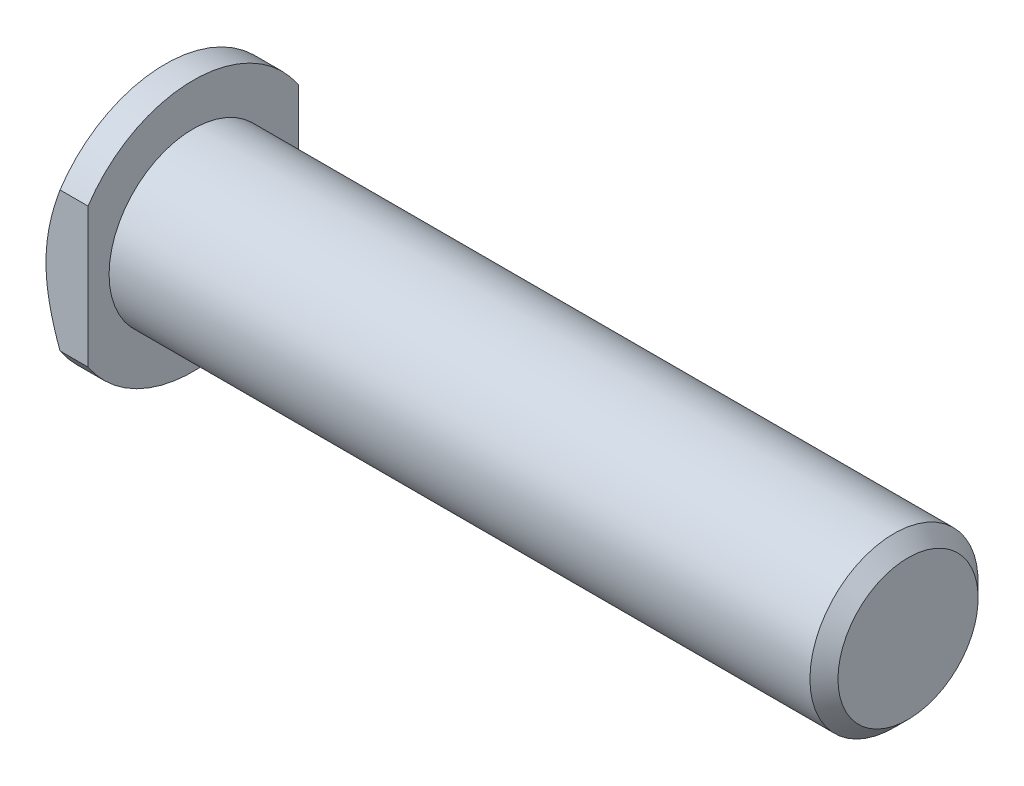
ISO-10303-21;
HEADER;
FILE_DESCRIPTION(('STEP AP214'),'2;1');
FILE_NAME('part.step','',(''),(''),'','','');
FILE_SCHEMA(('AUTOMOTIVE_DESIGN { 1 0 10303 214 1 1 1 1 }'));
ENDSEC;
DATA;
#1=APPLICATION_CONTEXT('core data for automotive mechanical design processes');
#2=APPLICATION_PROTOCOL_DEFINITION('international standard','automotive_design',2000,#1);
#3=PRODUCT_CONTEXT('',#1,'mechanical');
#4=PRODUCT('Part','Part','',(#3));
#5=PRODUCT_RELATED_PRODUCT_CATEGORY('part','',(#4));
#6=PRODUCT_DEFINITION_FORMATION('','',#4);
#7=PRODUCT_DEFINITION_CONTEXT('part definition',#1,'design');
#8=PRODUCT_DEFINITION('design','',#6,#7);
#9=PRODUCT_DEFINITION_SHAPE('','',#8);
#10=(LENGTH_UNIT() NAMED_UNIT(*) SI_UNIT(.MILLI.,.METRE.));
#11=(NAMED_UNIT(*) PLANE_ANGLE_UNIT() SI_UNIT($,.RADIAN.));
#12=(NAMED_UNIT(*) SI_UNIT($,.STERADIAN.) SOLID_ANGLE_UNIT());
#13=UNCERTAINTY_MEASURE_WITH_UNIT(LENGTH_MEASURE(1.E-05),#10,'distance_accuracy_value','');
#14=(GEOMETRIC_REPRESENTATION_CONTEXT(3) GLOBAL_UNCERTAINTY_ASSIGNED_CONTEXT((#13)) GLOBAL_UNIT_ASSIGNED_CONTEXT((#10,
#11,#12)) REPRESENTATION_CONTEXT('',''));
#15=CARTESIAN_POINT('',(0.,0.,0.));
#16=DIRECTION('',(0.,0.,1.));
#17=DIRECTION('',(1.,0.,0.));
#18=AXIS2_PLACEMENT_3D('',#15,#16,#17);
#19=CARTESIAN_POINT('',(8.00000000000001,12.,0.));
#20=DIRECTION('',(-1.,0.,0.));
#21=DIRECTION('',(0.,0.,1.));
#22=AXIS2_PLACEMENT_3D('',#19,#20,#21);
#23=PLANE('',#22);
#24=CARTESIAN_POINT('',(8.00000000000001,0.,0.));
#25=DIRECTION('',(-1.,0.,0.));
#26=DIRECTION('',(0.,0.,1.));
#27=AXIS2_PLACEMENT_3D('',#24,#25,#26);
#28=CIRCLE('',#27,12.);
#29=CARTESIAN_POINT('',(8.00000000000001,0.,12.));
#30=VERTEX_POINT('',#29);
#31=EDGE_CURVE('E95',#30,#30,#28,.T.);
#32=ORIENTED_EDGE('',*,*,#31,.T.);
#33=EDGE_LOOP('',(#32));
#34=FACE_BOUND('',#33,.T.);
#35=DIRECTION('',(0.,-1.,0.));
#36=VECTOR('',#35,1.);
#37=CARTESIAN_POINT('',(8.00000000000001,17.8551195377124,15.));
#38=LINE('',#37,#36);
#39=CARTESIAN_POINT('',(8.00000000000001,9.9498743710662,15.));
#40=VERTEX_POINT('',#39);
#41=CARTESIAN_POINT('',(8.00000000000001,-9.9498743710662,15.));
#42=VERTEX_POINT('',#41);
#43=EDGE_CURVE('E73',#40,#42,#38,.T.);
#44=ORIENTED_EDGE('',*,*,#43,.T.);
#45=CARTESIAN_POINT('',(8.00000000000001,0.,0.));
#46=DIRECTION('',(-1.,0.,0.));
#47=DIRECTION('',(0.,0.,1.));
#48=AXIS2_PLACEMENT_3D('',#45,#46,#47);
#49=CIRCLE('',#48,18.);
#50=CARTESIAN_POINT('',(8.00000000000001,-9.9498743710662,-15.));
#51=VERTEX_POINT('',#50);
#52=EDGE_CURVE('E92',#51,#42,#49,.T.);
#53=ORIENTED_EDGE('',*,*,#52,.F.);
#54=DIRECTION('',(0.,-1.,0.));
#55=VECTOR('',#54,1.);
#56=CARTESIAN_POINT('',(8.00000000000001,17.8551195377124,-15.));
#57=LINE('',#56,#55);
#58=CARTESIAN_POINT('',(8.00000000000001,9.9498743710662,-15.));
#59=VERTEX_POINT('',#58);
#60=EDGE_CURVE('E89',#59,#51,#57,.T.);
#61=ORIENTED_EDGE('',*,*,#60,.F.);
#62=EDGE_CURVE('E85',#40,#59,#49,.T.);
#63=ORIENTED_EDGE('',*,*,#62,.F.);
#64=EDGE_LOOP('',(#44,#53,#61,#63));
#65=FACE_BOUND('',#64,.T.);
#66=ADVANCED_FACE('F32',(#34,#65),#23,.F.);
#67=CARTESIAN_POINT('',(0.,0.,0.));
#68=DIRECTION('',(-1.,0.,0.));
#69=DIRECTION('',(0.,0.,1.));
#70=AXIS2_PLACEMENT_3D('',#67,#68,#69);
#71=CYLINDRICAL_SURFACE('',#70,18.);
#72=DIRECTION('',(-1.,0.,0.));
#73=VECTOR('',#72,1.);
#74=CARTESIAN_POINT('',(0.,9.9498743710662,15.));
#75=LINE('',#74,#73);
#76=CARTESIAN_POINT('',(4.00000000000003,9.9498743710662,15.));
#77=VERTEX_POINT('',#76);
#78=EDGE_CURVE('E47',#40,#77,#75,.T.);
#79=ORIENTED_EDGE('',*,*,#78,.F.);
#80=ORIENTED_EDGE('',*,*,#62,.T.);
#81=DIRECTION('',(-1.,0.,0.));
#82=VECTOR('',#81,1.);
#83=CARTESIAN_POINT('',(0.,9.9498743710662,-15.));
#84=LINE('',#83,#82);
#85=CARTESIAN_POINT('',(4.00000000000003,9.9498743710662,-15.));
#86=VERTEX_POINT('',#85);
#87=EDGE_CURVE('E93',#59,#86,#84,.T.);
#88=ORIENTED_EDGE('',*,*,#87,.T.);
#89=CARTESIAN_POINT('',(4.00000000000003,0.,0.));
#90=DIRECTION('',(1.,0.,0.));
#91=DIRECTION('',(0.,0.,-1.));
#92=AXIS2_PLACEMENT_3D('',#89,#90,#91);
#93=CIRCLE('',#92,18.);
#94=EDGE_CURVE('E88',#86,#77,#93,.T.);
#95=ORIENTED_EDGE('',*,*,#94,.T.);
#96=EDGE_LOOP('',(#79,#80,#88,#95));
#97=FACE_BOUND('',#96,.T.);
#98=ADVANCED_FACE('F83',(#97),#71,.T.);
#99=DIRECTION('',(-1.,0.,0.));
#100=VECTOR('',#99,1.);
#101=CARTESIAN_POINT('',(0.,-9.94987437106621,15.));
#102=LINE('',#101,#100);
#103=CARTESIAN_POINT('',(4.00000000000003,-9.9498743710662,15.));
#104=VERTEX_POINT('',#103);
#105=EDGE_CURVE('E75',#104,#42,#102,.F.);
#106=ORIENTED_EDGE('',*,*,#105,.F.);
#107=CARTESIAN_POINT('',(4.00000000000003,-9.9498743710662,-15.));
#108=VERTEX_POINT('',#107);
#109=EDGE_CURVE('E55',#104,#108,#93,.T.);
#110=ORIENTED_EDGE('',*,*,#109,.T.);
#111=DIRECTION('',(-1.,0.,0.));
#112=VECTOR('',#111,1.);
#113=CARTESIAN_POINT('',(0.,-9.94987437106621,-15.));
#114=LINE('',#113,#112);
#115=EDGE_CURVE('E96',#108,#51,#114,.F.);
#116=ORIENTED_EDGE('',*,*,#115,.T.);
#117=ORIENTED_EDGE('',*,*,#52,.T.);
#118=EDGE_LOOP('',(#106,#110,#116,#117));
#119=FACE_BOUND('',#118,.T.);
#120=ADVANCED_FACE('F129',(#119),#71,.T.);
#121=CARTESIAN_POINT('',(0.,0.,0.));
#122=DIRECTION('',(1.,0.,0.));
#123=DIRECTION('',(0.,0.,-1.));
#124=AXIS2_PLACEMENT_3D('',#121,#122,#123);
#125=CONICAL_SURFACE('',#124,12.,0.982793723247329);
#126=CARTESIAN_POINT('',(0.,0.,0.));
#127=DIRECTION('',(1.,0.,0.));
#128=DIRECTION('',(0.,0.,-1.));
#129=AXIS2_PLACEMENT_3D('',#126,#127,#128);
#130=CIRCLE('',#129,12.);
#131=CARTESIAN_POINT('',(0.,0.,-12.));
#132=VERTEX_POINT('',#131);
#133=EDGE_CURVE('E102',#132,#132,#130,.F.);
#134=ORIENTED_EDGE('',*,*,#133,.F.);
#135=EDGE_LOOP('',(#134));
#136=FACE_BOUND('',#135,.T.);
#137=ORIENTED_EDGE('',*,*,#109,.F.);
#138=CARTESIAN_POINT('',(13.2153555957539,-28.0660908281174,15.));
#139=CARTESIAN_POINT('',(13.0118041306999,-27.7198880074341,15.));
#140=CARTESIAN_POINT('',(12.808870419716,-27.3733220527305,15.));
#141=CARTESIAN_POINT('',(12.4043725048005,-26.6793895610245,15.));
#142=CARTESIAN_POINT('',(12.2028083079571,-26.3320230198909,15.));
#143=CARTESIAN_POINT('',(11.6003401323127,-25.2885575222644,15.));
#144=CARTESIAN_POINT('',(11.2016950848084,-24.5911512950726,15.));
#145=CARTESIAN_POINT('',(10.4104607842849,-23.1897769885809,15.));
#146=CARTESIAN_POINT('',(10.0178967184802,-22.4857946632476,15.));
#147=CARTESIAN_POINT('',(9.24206826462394,-21.0727469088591,15.));
#148=CARTESIAN_POINT('',(8.85880357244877,-20.3636816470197,15.));
#149=CARTESIAN_POINT('',(8.0775484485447,-18.8894504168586,15.));
#150=CARTESIAN_POINT('',(7.68040587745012,-18.1238325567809,15.));
#151=CARTESIAN_POINT('',(7.09782334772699,-16.9687264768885,15.));
#152=CARTESIAN_POINT('',(6.90580585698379,-16.5825529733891,15.));
#153=CARTESIAN_POINT('',(6.52683358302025,-15.8077325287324,15.));
#154=CARTESIAN_POINT('',(6.33987871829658,-15.419085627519,15.));
#155=CARTESIAN_POINT('',(5.97202552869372,-14.6395042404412,15.));
#156=CARTESIAN_POINT('',(5.79112017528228,-14.2485730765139,15.));
#157=CARTESIAN_POINT('',(5.43605699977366,-13.4636651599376,15.));
#158=CARTESIAN_POINT('',(5.26189898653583,-13.0696884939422,15.));
#159=CARTESIAN_POINT('',(4.92144545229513,-12.278426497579,15.));
#160=CARTESIAN_POINT('',(4.75514854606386,-11.881141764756,15.));
#161=CARTESIAN_POINT('',(4.43167879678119,-11.0828868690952,15.));
#162=CARTESIAN_POINT('',(4.27450548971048,-10.6819168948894,15.));
#163=CARTESIAN_POINT('',(3.97273926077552,-9.8811566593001,15.));
#164=CARTESIAN_POINT('',(3.82801023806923,-9.48141787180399,15.));
#165=CARTESIAN_POINT('',(3.55057647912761,-8.67777299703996,15.));
#166=CARTESIAN_POINT('',(3.41787167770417,-8.27386693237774,15.));
#167=CARTESIAN_POINT('',(3.1663755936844,-7.46171395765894,15.));
#168=CARTESIAN_POINT('',(3.04758460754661,-7.05346695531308,15.));
#169=CARTESIAN_POINT('',(2.82599529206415,-6.23262990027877,15.));
#170=CARTESIAN_POINT('',(2.72319686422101,-5.82003987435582,15.));
#171=CARTESIAN_POINT('',(2.53792243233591,-5.00027753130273,15.));
#172=CARTESIAN_POINT('',(2.45503290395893,-4.59319929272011,15.));
#173=CARTESIAN_POINT('',(2.30856942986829,-3.77556162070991,15.));
#174=CARTESIAN_POINT('',(2.24499514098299,-3.36500224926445,15.));
#175=CARTESIAN_POINT('',(2.13892229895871,-2.54128280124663,15.));
#176=CARTESIAN_POINT('',(2.0964168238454,-2.12812362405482,15.));
#177=CARTESIAN_POINT('',(2.03374554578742,-1.30010234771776,15.));
#178=CARTESIAN_POINT('',(2.0135795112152,-0.885240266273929,15.));
#179=CARTESIAN_POINT('',(1.99622042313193,-0.0540206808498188,15.));
#180=CARTESIAN_POINT('',(1.99908338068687,0.362338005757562,15.));
#181=CARTESIAN_POINT('',(2.02782051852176,1.19425427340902,15.));
#182=CARTESIAN_POINT('',(2.05369480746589,1.60981185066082,15.));
#183=CARTESIAN_POINT('',(2.12762764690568,2.43901465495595,15.));
#184=CARTESIAN_POINT('',(2.17569067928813,2.85265947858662,15.));
#185=CARTESIAN_POINT('',(2.29256462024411,3.67698972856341,15.));
#186=CARTESIAN_POINT('',(2.36137597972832,4.08767509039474,15.));
#187=CARTESIAN_POINT('',(2.52003393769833,4.91649038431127,15.));
#188=CARTESIAN_POINT('',(2.61040050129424,5.33452007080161,15.));
#189=CARTESIAN_POINT('',(2.80889749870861,6.16631621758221,15.));
#190=CARTESIAN_POINT('',(2.91702826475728,6.58008259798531,15.));
#191=CARTESIAN_POINT('',(3.14886963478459,7.40325258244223,15.));
#192=CARTESIAN_POINT('',(3.27258200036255,7.81265568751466,15.));
#193=CARTESIAN_POINT('',(3.53350979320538,8.62708584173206,15.));
#194=CARTESIAN_POINT('',(3.67072456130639,9.03211310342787,15.));
#195=CARTESIAN_POINT('',(4.06589011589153,10.1454449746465,15.));
#196=CARTESIAN_POINT('',(4.3360937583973,10.8494036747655,15.));
#197=CARTESIAN_POINT('',(4.90412713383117,12.2461519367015,15.));
#198=CARTESIAN_POINT('',(5.20196436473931,12.9389384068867,15.));
#199=CARTESIAN_POINT('',(5.81911432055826,14.315640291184,15.));
#200=CARTESIAN_POINT('',(6.13844772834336,14.9995463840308,15.));
#201=CARTESIAN_POINT('',(6.79350265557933,16.3593430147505,15.));
#202=CARTESIAN_POINT('',(7.12922263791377,17.0352342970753,15.));
#203=CARTESIAN_POINT('',(7.8149571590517,18.383265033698,15.));
#204=CARTESIAN_POINT('',(8.16502562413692,19.0553769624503,15.));
#205=CARTESIAN_POINT('',(8.87545145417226,20.394141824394,15.));
#206=CARTESIAN_POINT('',(9.23580900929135,21.0607946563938,15.));
#207=CARTESIAN_POINT('',(9.96458489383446,22.3892041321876,15.));
#208=CARTESIAN_POINT('',(10.3329987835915,23.050963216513,15.));
#209=CARTESIAN_POINT('',(11.0765277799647,24.3706934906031,15.));
#210=CARTESIAN_POINT('',(11.451642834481,25.0286647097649,15.));
#211=CARTESIAN_POINT('',(12.161227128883,26.2612509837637,15.));
#212=CARTESIAN_POINT('',(12.4950641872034,26.8362304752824,15.));
#213=CARTESIAN_POINT('',(13.1663541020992,27.9840759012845,15.));
#214=CARTESIAN_POINT('',(13.5038069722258,28.556941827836,15.));
#215=CARTESIAN_POINT('',(14.5208735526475,30.2729632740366,15.));
#216=CARTESIAN_POINT('',(15.205103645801,31.4133840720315,15.));
#217=CARTESIAN_POINT('',(16.2353087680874,33.114846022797,15.));
#218=CARTESIAN_POINT('',(16.5778239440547,33.6779903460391,15.));
#219=CARTESIAN_POINT('',(17.2648408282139,34.8030674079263,15.));
#220=CARTESIAN_POINT('',(17.6093425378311,35.3650001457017,15.));
#221=CARTESIAN_POINT('',(18.3000184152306,36.4876890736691,15.));
#222=CARTESIAN_POINT('',(18.646192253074,37.048445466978,15.));
#223=CARTESIAN_POINT('',(19.3400795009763,38.1690023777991,15.));
#224=CARTESIAN_POINT('',(19.6877929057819,38.7288028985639,15.));
#225=CARTESIAN_POINT('',(20.0361783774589,39.2881842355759,15.));
#226=B_SPLINE_CURVE_WITH_KNOTS('',3,(#138,#139,#140,#141,#142,#143,#144,#145,#146,#147,#148,
#149,#150,#151,#152,#153,#154,#155,#156,#157,#158,#159,#160,#161,#162,#163,#164,#165,#166,#167,
#168,#169,#170,#171,#172,#173,#174,#175,#176,#177,#178,#179,#180,#181,#182,#183,#184,#185,#186,
#187,#188,#189,#190,#191,#192,#193,#194,#195,#196,#197,#198,#199,#200,#201,#202,#203,#204,#205,
#206,#207,#208,#209,#210,#211,#212,#213,#214,#215,#216,#217,#218,#219,#220,#221,#222,#223,#224,
#225),.UNSPECIFIED.,.F.,.F.,(4,2,2,2,2,2,2,2,2,2,2,2,2,2,2,2,2,2,2,2,2,2,2,2,2,2,2,2,2,2,2,2,2,
2,2,2,2,2,2,2,2,2,2,4),(0.,1.20482515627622,2.40965654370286,4.81952335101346,7.23758072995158,
9.65555892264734,12.2428369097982,13.536641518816,14.8304252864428,16.1226496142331,
17.4148373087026,18.706796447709,19.9986898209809,21.2739224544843,22.5491481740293,
23.824401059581,25.0996460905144,26.3455204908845,27.5913727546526,28.836815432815,
30.0822451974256,31.3307050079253,32.579170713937,33.8278887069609,35.0766338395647,
36.3592521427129,37.6418944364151,38.9246818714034,40.2074067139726,42.46865583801,
44.7305203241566,46.9945930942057,49.258453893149,51.5317856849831,53.8051595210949,
56.0773106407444,58.3494441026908,60.3440312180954,62.3386258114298,66.3283638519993,
68.3057423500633,70.2831222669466,72.2601267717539,74.2371245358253),.UNSPECIFIED.);
#227=EDGE_CURVE('E112',#104,#77,#226,.T.);
#228=ORIENTED_EDGE('',*,*,#227,.T.);
#229=ORIENTED_EDGE('',*,*,#94,.F.);
#230=CARTESIAN_POINT('',(13.2153555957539,-28.0660908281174,-15.));
#231=CARTESIAN_POINT('',(13.0118041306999,-27.7198880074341,-15.));
#232=CARTESIAN_POINT('',(12.808870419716,-27.3733220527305,-15.));
#233=CARTESIAN_POINT('',(12.4043725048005,-26.6793895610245,-15.));
#234=CARTESIAN_POINT('',(12.2028083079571,-26.3320230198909,-15.));
#235=CARTESIAN_POINT('',(11.6003401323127,-25.2885575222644,-15.));
#236=CARTESIAN_POINT('',(11.2016950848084,-24.5911512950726,-15.));
#237=CARTESIAN_POINT('',(10.4104607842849,-23.1897769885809,-15.));
#238=CARTESIAN_POINT('',(10.0178967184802,-22.4857946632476,-15.));
#239=CARTESIAN_POINT('',(9.24206826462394,-21.0727469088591,-15.));
#240=CARTESIAN_POINT('',(8.85880357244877,-20.3636816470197,-15.));
#241=CARTESIAN_POINT('',(8.0775484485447,-18.8894504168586,-15.));
#242=CARTESIAN_POINT('',(7.68040587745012,-18.1238325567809,-15.));
#243=CARTESIAN_POINT('',(7.09782334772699,-16.9687264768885,-15.));
#244=CARTESIAN_POINT('',(6.90580585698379,-16.5825529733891,-15.));
#245=CARTESIAN_POINT('',(6.52683358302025,-15.8077325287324,-15.));
#246=CARTESIAN_POINT('',(6.33987871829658,-15.419085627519,-15.));
#247=CARTESIAN_POINT('',(5.97202552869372,-14.6395042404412,-15.));
#248=CARTESIAN_POINT('',(5.79112017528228,-14.2485730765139,-15.));
#249=CARTESIAN_POINT('',(5.43605699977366,-13.4636651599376,-15.));
#250=CARTESIAN_POINT('',(5.26189898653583,-13.0696884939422,-15.));
#251=CARTESIAN_POINT('',(4.92144545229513,-12.278426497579,-15.));
#252=CARTESIAN_POINT('',(4.75514854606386,-11.881141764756,-15.));
#253=CARTESIAN_POINT('',(4.43167879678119,-11.0828868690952,-15.));
#254=CARTESIAN_POINT('',(4.27450548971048,-10.6819168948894,-15.));
#255=CARTESIAN_POINT('',(3.97273926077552,-9.8811566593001,-15.));
#256=CARTESIAN_POINT('',(3.82801023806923,-9.48141787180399,-15.));
#257=CARTESIAN_POINT('',(3.55057647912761,-8.67777299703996,-15.));
#258=CARTESIAN_POINT('',(3.41787167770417,-8.27386693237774,-15.));
#259=CARTESIAN_POINT('',(3.1663755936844,-7.46171395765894,-15.));
#260=CARTESIAN_POINT('',(3.04758460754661,-7.05346695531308,-15.));
#261=CARTESIAN_POINT('',(2.82599529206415,-6.23262990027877,-15.));
#262=CARTESIAN_POINT('',(2.72319686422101,-5.82003987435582,-15.));
#263=CARTESIAN_POINT('',(2.53792243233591,-5.00027753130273,-15.));
#264=CARTESIAN_POINT('',(2.45503290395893,-4.59319929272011,-15.));
#265=CARTESIAN_POINT('',(2.30856942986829,-3.77556162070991,-15.));
#266=CARTESIAN_POINT('',(2.24499514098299,-3.36500224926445,-15.));
#267=CARTESIAN_POINT('',(2.13892229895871,-2.54128280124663,-15.));
#268=CARTESIAN_POINT('',(2.0964168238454,-2.12812362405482,-15.));
#269=CARTESIAN_POINT('',(2.03374554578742,-1.30010234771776,-15.));
#270=CARTESIAN_POINT('',(2.0135795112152,-0.885240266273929,-15.));
#271=CARTESIAN_POINT('',(1.99622042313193,-0.0540206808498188,-15.));
#272=CARTESIAN_POINT('',(1.99908338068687,0.362338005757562,-15.));
#273=CARTESIAN_POINT('',(2.02782051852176,1.19425427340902,-15.));
#274=CARTESIAN_POINT('',(2.05369480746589,1.60981185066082,-15.));
#275=CARTESIAN_POINT('',(2.12762764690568,2.43901465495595,-15.));
#276=CARTESIAN_POINT('',(2.17569067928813,2.85265947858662,-15.));
#277=CARTESIAN_POINT('',(2.29256462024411,3.67698972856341,-15.));
#278=CARTESIAN_POINT('',(2.36137597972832,4.08767509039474,-15.));
#279=CARTESIAN_POINT('',(2.52003393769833,4.91649038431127,-15.));
#280=CARTESIAN_POINT('',(2.61040050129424,5.33452007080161,-15.));
#281=CARTESIAN_POINT('',(2.80889749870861,6.16631621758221,-15.));
#282=CARTESIAN_POINT('',(2.91702826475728,6.58008259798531,-15.));
#283=CARTESIAN_POINT('',(3.14886963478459,7.40325258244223,-15.));
#284=CARTESIAN_POINT('',(3.27258200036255,7.81265568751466,-15.));
#285=CARTESIAN_POINT('',(3.53350979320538,8.62708584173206,-15.));
#286=CARTESIAN_POINT('',(3.67072456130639,9.03211310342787,-15.));
#287=CARTESIAN_POINT('',(4.06589011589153,10.1454449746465,-15.));
#288=CARTESIAN_POINT('',(4.3360937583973,10.8494036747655,-15.));
#289=CARTESIAN_POINT('',(4.90412713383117,12.2461519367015,-15.));
#290=CARTESIAN_POINT('',(5.20196436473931,12.9389384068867,-15.));
#291=CARTESIAN_POINT('',(5.81911432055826,14.315640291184,-15.));
#292=CARTESIAN_POINT('',(6.13844772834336,14.9995463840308,-15.));
#293=CARTESIAN_POINT('',(6.79350265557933,16.3593430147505,-15.));
#294=CARTESIAN_POINT('',(7.12922263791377,17.0352342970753,-15.));
#295=CARTESIAN_POINT('',(7.8149571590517,18.383265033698,-15.));
#296=CARTESIAN_POINT('',(8.16502562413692,19.0553769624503,-15.));
#297=CARTESIAN_POINT('',(8.87545145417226,20.394141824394,-15.));
#298=CARTESIAN_POINT('',(9.23580900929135,21.0607946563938,-15.));
#299=CARTESIAN_POINT('',(9.96458489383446,22.3892041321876,-15.));
#300=CARTESIAN_POINT('',(10.3329987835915,23.050963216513,-15.));
#301=CARTESIAN_POINT('',(11.0765277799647,24.3706934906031,-15.));
#302=CARTESIAN_POINT('',(11.451642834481,25.0286647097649,-15.));
#303=CARTESIAN_POINT('',(12.161227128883,26.2612509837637,-15.));
#304=CARTESIAN_POINT('',(12.4950641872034,26.8362304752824,-15.));
#305=CARTESIAN_POINT('',(13.1663541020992,27.9840759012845,-15.));
#306=CARTESIAN_POINT('',(13.5038069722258,28.556941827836,-15.));
#307=CARTESIAN_POINT('',(14.5208735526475,30.2729632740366,-15.));
#308=CARTESIAN_POINT('',(15.205103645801,31.4133840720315,-15.));
#309=CARTESIAN_POINT('',(16.2353087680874,33.114846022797,-15.));
#310=CARTESIAN_POINT('',(16.5778239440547,33.6779903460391,-15.));
#311=CARTESIAN_POINT('',(17.2648408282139,34.8030674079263,-15.));
#312=CARTESIAN_POINT('',(17.6093425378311,35.3650001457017,-15.));
#313=CARTESIAN_POINT('',(18.3000184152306,36.4876890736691,-15.));
#314=CARTESIAN_POINT('',(18.646192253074,37.048445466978,-15.));
#315=CARTESIAN_POINT('',(19.3400795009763,38.1690023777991,-15.));
#316=CARTESIAN_POINT('',(19.6877929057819,38.7288028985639,-15.));
#317=CARTESIAN_POINT('',(20.0361783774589,39.2881842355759,-15.));
#318=B_SPLINE_CURVE_WITH_KNOTS('',3,(#230,#231,#232,#233,#234,#235,#236,#237,#238,#239,#240,
#241,#242,#243,#244,#245,#246,#247,#248,#249,#250,#251,#252,#253,#254,#255,#256,#257,#258,#259,
#260,#261,#262,#263,#264,#265,#266,#267,#268,#269,#270,#271,#272,#273,#274,#275,#276,#277,#278,
#279,#280,#281,#282,#283,#284,#285,#286,#287,#288,#289,#290,#291,#292,#293,#294,#295,#296,#297,
#298,#299,#300,#301,#302,#303,#304,#305,#306,#307,#308,#309,#310,#311,#312,#313,#314,#315,#316,
#317),.UNSPECIFIED.,.F.,.F.,(4,2,2,2,2,2,2,2,2,2,2,2,2,2,2,2,2,2,2,2,2,2,2,2,2,2,2,2,2,2,2,2,2,
2,2,2,2,2,2,2,2,2,2,4),(0.,1.20482515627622,2.40965654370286,4.81952335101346,7.23758072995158,
9.65555892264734,12.2428369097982,13.536641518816,14.8304252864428,16.1226496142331,
17.4148373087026,18.706796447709,19.9986898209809,21.2739224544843,22.5491481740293,
23.824401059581,25.0996460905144,26.3455204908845,27.5913727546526,28.836815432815,
30.0822451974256,31.3307050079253,32.579170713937,33.8278887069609,35.0766338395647,
36.3592521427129,37.6418944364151,38.9246818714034,40.2074067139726,42.46865583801,
44.7305203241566,46.9945930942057,49.258453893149,51.5317856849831,53.8051595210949,
56.0773106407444,58.3494441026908,60.3440312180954,62.3386258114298,66.3283638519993,
68.3057423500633,70.2831222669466,72.2601267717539,74.2371245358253),.UNSPECIFIED.);
#319=EDGE_CURVE('E106',#108,#86,#318,.T.);
#320=ORIENTED_EDGE('',*,*,#319,.F.);
#321=EDGE_LOOP('',(#137,#228,#229,#320));
#322=FACE_BOUND('',#321,.T.);
#323=ADVANCED_FACE('F117',(#136,#322),#125,.T.);
#324=CARTESIAN_POINT('',(0.,18.,0.));
#325=DIRECTION('',(1.,0.,0.));
#326=DIRECTION('',(0.,0.,-1.));
#327=AXIS2_PLACEMENT_3D('',#324,#325,#326);
#328=PLANE('',#327);
#329=ORIENTED_EDGE('',*,*,#133,.T.);
#330=EDGE_LOOP('',(#329));
#331=FACE_BOUND('',#330,.T.);
#332=ADVANCED_FACE('F138',(#331),#328,.F.);
#333=CARTESIAN_POINT('',(110.,0.,0.));
#334=DIRECTION('',(-1.,0.,0.));
#335=DIRECTION('',(0.,0.,1.));
#336=AXIS2_PLACEMENT_3D('',#333,#334,#335);
#337=PLANE('',#336);
#338=CARTESIAN_POINT('',(110.,0.,0.));
#339=DIRECTION('',(-1.,0.,0.));
#340=DIRECTION('',(0.,0.,1.));
#341=AXIS2_PLACEMENT_3D('',#338,#339,#340);
#342=CIRCLE('',#341,9.99999999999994);
#343=CARTESIAN_POINT('',(110.,0.,9.99999999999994));
#344=VERTEX_POINT('',#343);
#345=EDGE_CURVE('E11',#344,#344,#342,.F.);
#346=ORIENTED_EDGE('',*,*,#345,.T.);
#347=EDGE_LOOP('',(#346));
#348=FACE_BOUND('',#347,.T.);
#349=ADVANCED_FACE('F135',(#348),#337,.F.);
#350=CARTESIAN_POINT('',(0.,0.,0.));
#351=DIRECTION('',(-1.,0.,0.));
#352=DIRECTION('',(0.,0.,1.));
#353=AXIS2_PLACEMENT_3D('',#350,#351,#352);
#354=CYLINDRICAL_SURFACE('',#353,12.);
#355=CARTESIAN_POINT('',(108.,0.,0.));
#356=DIRECTION('',(-1.,0.,0.));
#357=DIRECTION('',(0.,0.,1.));
#358=AXIS2_PLACEMENT_3D('',#355,#356,#357);
#359=CIRCLE('',#358,12.);
#360=CARTESIAN_POINT('',(108.,0.,12.));
#361=VERTEX_POINT('',#360);
#362=EDGE_CURVE('E40',#361,#361,#359,.T.);
#363=ORIENTED_EDGE('',*,*,#362,.T.);
#364=EDGE_LOOP('',(#363));
#365=FACE_BOUND('',#364,.T.);
#366=ORIENTED_EDGE('',*,*,#31,.F.);
#367=EDGE_LOOP('',(#366));
#368=FACE_BOUND('',#367,.T.);
#369=ADVANCED_FACE('F124',(#365,#368),#354,.T.);
#370=CARTESIAN_POINT('',(46.5045797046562,17.8551195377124,-15.));
#371=DIRECTION('',(0.,0.,1.));
#372=DIRECTION('',(0.,-1.,0.));
#373=AXIS2_PLACEMENT_3D('',#370,#371,#372);
#374=PLANE('',#373);
#375=ORIENTED_EDGE('',*,*,#60,.T.);
#376=ORIENTED_EDGE('',*,*,#115,.F.);
#377=ORIENTED_EDGE('',*,*,#319,.T.);
#378=ORIENTED_EDGE('',*,*,#87,.F.);
#379=EDGE_LOOP('',(#375,#376,#377,#378));
#380=FACE_BOUND('',#379,.T.);
#381=ADVANCED_FACE('F120',(#380),#374,.F.);
#382=CARTESIAN_POINT('',(46.5045797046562,17.8551195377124,15.));
#383=DIRECTION('',(0.,0.,1.));
#384=DIRECTION('',(0.,-1.,0.));
#385=AXIS2_PLACEMENT_3D('',#382,#383,#384);
#386=PLANE('',#385);
#387=ORIENTED_EDGE('',*,*,#78,.T.);
#388=ORIENTED_EDGE('',*,*,#227,.F.);
#389=ORIENTED_EDGE('',*,*,#105,.T.);
#390=ORIENTED_EDGE('',*,*,#43,.F.);
#391=EDGE_LOOP('',(#387,#388,#389,#390));
#392=FACE_BOUND('',#391,.T.);
#393=ADVANCED_FACE('F74',(#392),#386,.T.);
#394=CARTESIAN_POINT('',(108.,0.,0.));
#395=DIRECTION('',(-1.,0.,0.));
#396=DIRECTION('',(0.,0.,1.));
#397=AXIS2_PLACEMENT_3D('',#394,#395,#396);
#398=CONICAL_SURFACE('',#397,12.,0.785398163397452);
#399=ORIENTED_EDGE('',*,*,#345,.F.);
#400=EDGE_LOOP('',(#399));
#401=FACE_BOUND('',#400,.T.);
#402=ORIENTED_EDGE('',*,*,#362,.F.);
#403=EDGE_LOOP('',(#402));
#404=FACE_BOUND('',#403,.T.);
#405=ADVANCED_FACE('F34',(#401,#404),#398,.T.);
#406=CLOSED_SHELL('',(#66,#98,#120,#323,#332,#349,#369,#381,#393,#405));
#407=MANIFOLD_SOLID_BREP('B2',#406);
#408=ADVANCED_BREP_SHAPE_REPRESENTATION('',(#18,#407),#14);
#409=SHAPE_DEFINITION_REPRESENTATION(#9,#408);
ENDSEC;
END-ISO-10303-21;
